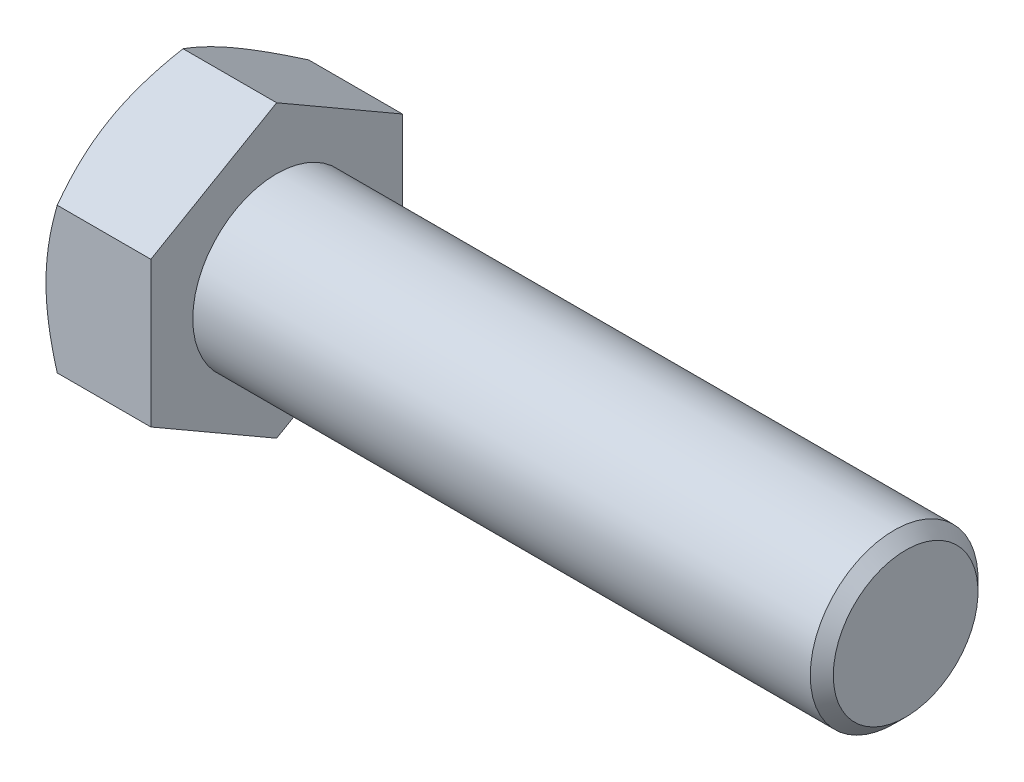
from build123d import *

# Parameters (mm, degrees)
BASEHEAD_DEPTH = 15


with BuildPart() as part:
    # BaseHeadSke → BaseHead (new body)
    with BuildSketch(Plane(origin=(0, 0, 0), x_dir=(0, 0, -1), z_dir=(1, 0, 0))):
        Polygon((0, 20.784609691), (-18, 10.392304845), (-18, -10.392304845), (0, -20.784609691), (18, -10.392304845), (18, 10.392304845), align=None)
    extrude(amount=BASEHEAD_DEPTH)

    # HeadChamferSke → HeadChamfer (revolve, cut)
    with BuildSketch(Plane.XY):
        Polygon((0, 20.784609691), (0, 18), (1.607695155, 20.784609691), align=None)
    revolve(axis=Axis((0, 0, 0), (1, 0, 0)), mode=Mode.SUBTRACT)

    # BodySke → BaseBody (revolve)
    with BuildSketch(Plane.XY, mode=Mode.PRIVATE) as basebody_sk:
        Polygon((0, 0), (0, 12), (103.352, 12), (105, 10.352), (105, 0), align=None)
    revolve(basebody_sk.sketch.rotate(Axis((0, 0, 0), (1, 0, 0)), 90), axis=Axis((0, 0, 0), (1, 0, 0)))


solid = part.part
